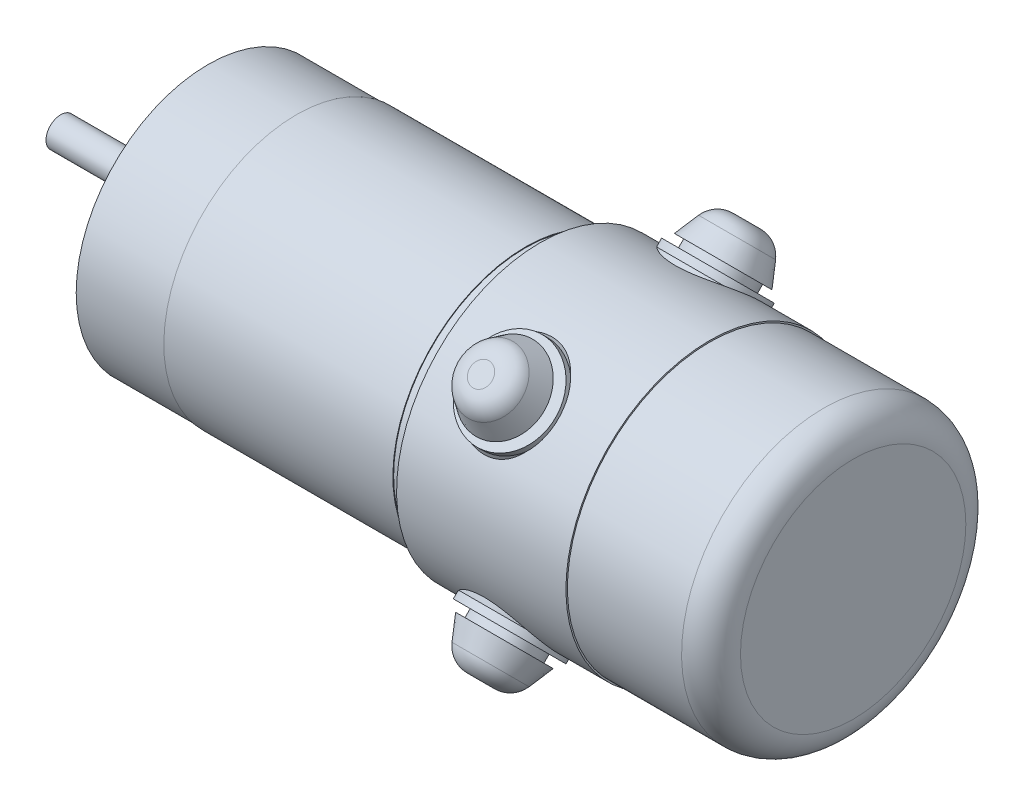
from build123d import *

# Parameters (mm, degrees)
ESQUISSE2_R                        = 2
BOSS_EXTRU_1_DEPTH                 = 17
BOSS_EXTRU_2_REACH                 = 121.979
BOSS_EXTRU_2_END_RADIUS            = 19.5
ESQUISSE3_R                        = 3.5
BOSS_EXTRU_2_DRAFT                 = 23
CONG_1_R                           = 3
BOSS_EXTRU_3_REACH                 = 119.649
ESQUISSE4_R                        = 6.25
ESQUISSE5_R                        = 5.834611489
ESQUISSE5_R_2                      = 4.38
ENL_V_MAT_EXTRU_1_DEPTH            = 1
R_P_TITION_CIRCULAIRE1_COUNT       = 4
CONG_1_OF_R_P_TITION_CIRCULAIRE1_R = 3
R_P_TITION_CIRCULAIRE2_COUNT       = 4


with BuildPart() as part:
    # Esquisse1 → Base-R_volution (revolve)
    with BuildSketch(Plane.XY):
        with BuildLine():
            Line((0, 0), (0, 15.3))
            ThreePointArc((0, 15.3), (-1.171572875, 18.128427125), (-4, 19.3))
            Line((-4, 19.3), (-19.5, 19.3))
            Line((-19.5, 19.3), (-19.5, 19.5))
            Line((-19.5, 19.5), (-42.5, 19.5))
            Line((-42.5, 19.5), (-42.5, 17.9))
            Line((-42.5, 17.9), (-44.5, 17.9))
            Line((-44.5, 17.9), (-44.5, 18))
            Line((-44.5, 18), (-75.6, 18))
            Line((-75.6, 18), (-75.6, 17.9))
            Line((-75.6, 17.9), (-87.6, 17.9))
            Line((-87.6, 17.9), (-87.6, 9))
            Line((-87.6, 9), (-90.6, 9))
            Line((-90.6, 9), (-90.6, 1))
            Line((-90.6, 1), (-83.6, 1))
            Line((-83.6, 1), (-83.6, 13))
            Line((-83.6, 13), (-8, 13))
            Line((-8, 13), (-8, 0))
            Line((-8, 0), (0, 0))
        make_face()
    revolve(axis=Axis((0, 0, 0), (-1, 0, 0)))

    # Esquisse2 → Boss.-Extru.1 (add)
    with BuildSketch(Plane.ZY.offset(90.6)):
        with Locations(Location((0, 0, 0), (0, 0, 270))):
            Circle(ESQUISSE2_R)
    extrude(amount=BOSS_EXTRU_1_DEPTH)

    # Boss.-Extru.2: up to this cylinder (the profile starts outside it)
    boss_extru_2_end = Plane(origin=(-32.5, 0, 0), z_dir=(1, 0, 0)) * Cylinder(BOSS_EXTRU_2_END_RADIUS, 283.958, mode=Mode.PRIVATE)



with BuildPart() as boss_extru_2_long_prism_1:
    # Esquisse3 → Boss.-Extru.2 (the long prism of profile 1, to be tilted and cut off)
    with BuildSketch(Plane(origin=(0, 18.03122292, 18.03122292), x_dir=(-1, 0, 0), z_dir=(0, 0.7071067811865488, 0.7071067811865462))):
        with Locations((32.5, 0)):
            Circle(ESQUISSE3_R)
    extrude(amount=-BOSS_EXTRU_2_REACH)
    boss_extru_2_tool1_sides = [boss_extru_2_long_prism_1.faces().sort_by_distance(p)[0] for p in [
        (-29, -25.094866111, -25.094866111),
    ]]
    draft(boss_extru_2_tool1_sides, Plane(origin=(0, 18.03122292, 18.03122292), x_dir=(-1, 0, 0), z_dir=(0, 0.7071067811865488, 0.7071067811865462)), BOSS_EXTRU_2_DRAFT)  # the draft: side faces tilted about the start plane


with BuildPart() as part_1:
    add(part.part)
    boss_extru_2_tool1 = boss_extru_2_long_prism_1.part - boss_extru_2_end
    boss_extru_2 = boss_extru_2_tool1.solids().sort_by_distance((-32.5, 18.031223, 18.031223))[0]
    add(boss_extru_2)

    # Cong_1
    cong_1_edges = [part_1.edges().sort_by_distance(p)[0] for p in [
        (-29, 18.03122292, 18.03122292),
    ]]
    fillet(cong_1_edges, radius=CONG_1_R)

    # Esquisse4 → Boss.-Extru.3 (add, up to next)
    with BuildSketch(Plane(origin=(0, 14.142135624, 14.142135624), x_dir=(-1, 0, 0), z_dir=(0, 0.7071067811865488, 0.7071067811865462)), mode=Mode.PRIVATE) as boss_extru_3_sk1:
        with Locations(Location((32.5, 0, 0), (0, 0, 90))):
            Circle(ESQUISSE4_R)
    boss_extru_3_tool1 = extrude(boss_extru_3_sk1.sketch, amount=-BOSS_EXTRU_3_REACH, mode=Mode.PRIVATE) - part_1.part
    boss_extru_3 = boss_extru_3_tool1.solids().sort_by_distance((-32.5, 14.142136, 14.142136))[0]
    add(boss_extru_3)

    # Esquisse5 → Enl_v. mat.-Extru.1 (cut)
    with BuildSketch(Plane(origin=(0, 14.142135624, 14.142135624), x_dir=(-1, 0, 0), z_dir=(0, 0.7071067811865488, 0.7071067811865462))):
        with Locations((32.5, 0)):
            Circle(ESQUISSE5_R)
        with Locations(Location((32.5, 0, 0), (0, 0, 90))):
            Circle(ESQUISSE5_R_2, mode=Mode.SUBTRACT)
    enl_v_mat_extru_1 = extrude(amount=ENL_V_MAT_EXTRU_1_DEPTH, mode=Mode.SUBTRACT)

    # R_p_tition circulaire1: Boss.-Extru.2, Boss.-Extru.3, Enl_v. mat.-Extru.1 ×4 about axis
    r_p_tition_circulaire1_axis = Axis((0, 0, 0), (1, 0, 0))
    add([boss_extru_2.rotate(r_p_tition_circulaire1_axis, i * 360 / R_P_TITION_CIRCULAIRE1_COUNT) for i in range(1, R_P_TITION_CIRCULAIRE1_COUNT)])
    add([boss_extru_3.rotate(r_p_tition_circulaire1_axis, i * 360 / R_P_TITION_CIRCULAIRE1_COUNT) for i in range(1, R_P_TITION_CIRCULAIRE1_COUNT)])
    add([enl_v_mat_extru_1.rotate(r_p_tition_circulaire1_axis, i * 360 / R_P_TITION_CIRCULAIRE1_COUNT) for i in range(1, R_P_TITION_CIRCULAIRE1_COUNT)], mode=Mode.SUBTRACT)

    # Cong_1 of R_p_tition circulaire1
    cong_1_of_r_p_tition_circulaire1_edges = [part_1.edges().sort_by_distance(p)[0] for p in [
        (-29, -18.03122292, 18.03122292),
        (-29, -18.03122292, -18.03122292),
        (-29, 18.03122292, -18.03122292),
    ]]
    fillet(cong_1_of_r_p_tition_circulaire1_edges, radius=CONG_1_OF_R_P_TITION_CIRCULAIRE1_R)

    # Esquisse6 → Trou taraud_ M4x0.71 (revolve, cut)
    with BuildSketch(Plane(origin=(-87.6, 9.899494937, 9.899494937), x_dir=(0, 0, 1), z_dir=(0, 1, 0))):
        Polygon((0, 0), (0, 9.491420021), (1.65, 8.5), (1.65, 0), align=None)
    trou_taraud_m4x0_71 = revolve(axis=Axis((-93.95, 9.899494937, 9.899494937), (1, 0, 0)), mode=Mode.SUBTRACT)

    # R_p_tition circulaire2: Trou taraud_ M4x0.71 ×4 about axis
    r_p_tition_circulaire2_axis = Axis((0, 0, 0), (1, 0, 0))
    for i in range(1, R_P_TITION_CIRCULAIRE2_COUNT):
        add(trou_taraud_m4x0_71.rotate(r_p_tition_circulaire2_axis, i * 360 / R_P_TITION_CIRCULAIRE2_COUNT), mode=Mode.SUBTRACT)


solid = part_1.part
